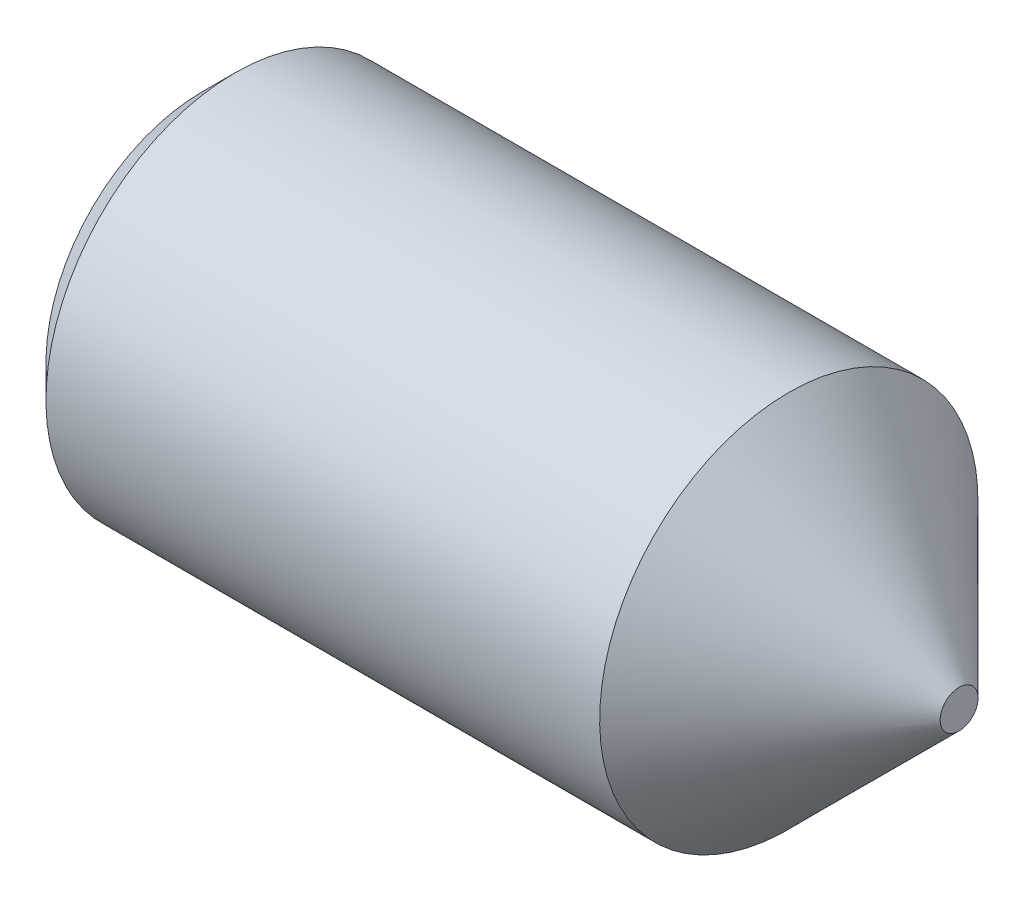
ISO-10303-21;
HEADER;
FILE_DESCRIPTION(('STEP AP214'),'2;1');
FILE_NAME('part.step','',(''),(''),'','','');
FILE_SCHEMA(('AUTOMOTIVE_DESIGN { 1 0 10303 214 1 1 1 1 }'));
ENDSEC;
DATA;
#1=APPLICATION_CONTEXT('core data for automotive mechanical design processes');
#2=APPLICATION_PROTOCOL_DEFINITION('international standard','automotive_design',2000,#1);
#3=PRODUCT_CONTEXT('',#1,'mechanical');
#4=PRODUCT('Part','Part','',(#3));
#5=PRODUCT_RELATED_PRODUCT_CATEGORY('part','',(#4));
#6=PRODUCT_DEFINITION_FORMATION('','',#4);
#7=PRODUCT_DEFINITION_CONTEXT('part definition',#1,'design');
#8=PRODUCT_DEFINITION('design','',#6,#7);
#9=PRODUCT_DEFINITION_SHAPE('','',#8);
#10=(LENGTH_UNIT() NAMED_UNIT(*) SI_UNIT(.MILLI.,.METRE.));
#11=(NAMED_UNIT(*) PLANE_ANGLE_UNIT() SI_UNIT($,.RADIAN.));
#12=(NAMED_UNIT(*) SI_UNIT($,.STERADIAN.) SOLID_ANGLE_UNIT());
#13=UNCERTAINTY_MEASURE_WITH_UNIT(LENGTH_MEASURE(1.E-05),#10,'distance_accuracy_value','');
#14=(GEOMETRIC_REPRESENTATION_CONTEXT(3) GLOBAL_UNCERTAINTY_ASSIGNED_CONTEXT((#13)) GLOBAL_UNIT_ASSIGNED_CONTEXT((#10,
#11,#12)) REPRESENTATION_CONTEXT('',''));
#15=CARTESIAN_POINT('',(0.,0.,0.));
#16=DIRECTION('',(0.,0.,1.));
#17=DIRECTION('',(1.,0.,0.));
#18=AXIS2_PLACEMENT_3D('',#15,#16,#17);
#19=CARTESIAN_POINT('',(10.,0.,0.));
#20=DIRECTION('',(1.,0.,0.));
#21=DIRECTION('',(0.,1.,0.));
#22=AXIS2_PLACEMENT_3D('',#19,#20,#21);
#23=PLANE('',#22);
#24=CARTESIAN_POINT('',(10.,0.,0.));
#25=DIRECTION('',(1.,0.,0.));
#26=DIRECTION('',(0.,1.,0.));
#27=AXIS2_PLACEMENT_3D('',#24,#25,#26);
#28=CIRCLE('',#27,0.25);
#29=CARTESIAN_POINT('',(10.,0.25,0.));
#30=VERTEX_POINT('',#29);
#31=EDGE_CURVE('E10',#30,#30,#28,.T.);
#32=ORIENTED_EDGE('',*,*,#31,.T.);
#33=EDGE_LOOP('',(#32));
#34=FACE_BOUND('',#33,.T.);
#35=ADVANCED_FACE('F16',(#34),#23,.T.);
#36=CARTESIAN_POINT('',(8.875,0.,0.));
#37=DIRECTION('',(-1.,0.,0.));
#38=DIRECTION('',(0.,-1.,0.));
#39=AXIS2_PLACEMENT_3D('',#36,#37,#38);
#40=CONICAL_SURFACE('',#39,1.375,0.78539816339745);
#41=ORIENTED_EDGE('',*,*,#31,.F.);
#42=EDGE_LOOP('',(#41));
#43=FACE_BOUND('',#42,.T.);
#44=CARTESIAN_POINT('',(7.75,0.,0.));
#45=DIRECTION('',(1.,0.,0.));
#46=DIRECTION('',(0.,1.,0.));
#47=AXIS2_PLACEMENT_3D('',#44,#45,#46);
#48=CIRCLE('',#47,2.5);
#49=CARTESIAN_POINT('',(7.75,2.5,0.));
#50=VERTEX_POINT('',#49);
#51=EDGE_CURVE('E27',#50,#50,#48,.T.);
#52=ORIENTED_EDGE('',*,*,#51,.T.);
#53=EDGE_LOOP('',(#52));
#54=FACE_BOUND('',#53,.T.);
#55=ADVANCED_FACE('F291',(#43,#54),#40,.T.);
#56=CARTESIAN_POINT('',(0.433012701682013,0.,0.));
#57=DIRECTION('',(1.,0.,0.));
#58=DIRECTION('',(0.,1.,0.));
#59=AXIS2_PLACEMENT_3D('',#56,#57,#58);
#60=CYLINDRICAL_SURFACE('',#59,2.5);
#61=ORIENTED_EDGE('',*,*,#51,.F.);
#62=EDGE_LOOP('',(#61));
#63=FACE_BOUND('',#62,.T.);
#64=CARTESIAN_POINT('',(0.433012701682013,0.,0.));
#65=DIRECTION('',(1.,0.,0.));
#66=DIRECTION('',(0.,1.,0.));
#67=AXIS2_PLACEMENT_3D('',#64,#65,#66);
#68=CIRCLE('',#67,2.5);
#69=CARTESIAN_POINT('',(0.433012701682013,2.5,0.));
#70=VERTEX_POINT('',#69);
#71=EDGE_CURVE('E154',#70,#70,#68,.T.);
#72=ORIENTED_EDGE('',*,*,#71,.T.);
#73=EDGE_LOOP('',(#72));
#74=FACE_BOUND('',#73,.T.);
#75=ADVANCED_FACE('F18',(#63,#74),#60,.T.);
#76=CARTESIAN_POINT('',(3.,0.,0.));
#77=DIRECTION('',(-1.,0.,0.));
#78=DIRECTION('',(0.,0.,1.));
#79=AXIS2_PLACEMENT_3D('',#76,#77,#78);
#80=PLANE('',#79);
#81=DIRECTION('',(0.,-0.5,-0.86602540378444));
#82=VECTOR('',#81,1.);
#83=CARTESIAN_POINT('',(3.,1.44337567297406,0.));
#84=LINE('',#83,#82);
#85=CARTESIAN_POINT('',(3.,1.44337567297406,0.));
#86=VERTEX_POINT('',#85);
#87=CARTESIAN_POINT('',(3.,0.721687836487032,-1.25));
#88=VERTEX_POINT('',#87);
#89=EDGE_CURVE('E20',#86,#88,#84,.T.);
#90=ORIENTED_EDGE('',*,*,#89,.T.);
#91=DIRECTION('',(0.,-1.,0.));
#92=VECTOR('',#91,1.);
#93=CARTESIAN_POINT('',(3.,0.721687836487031,-1.25));
#94=LINE('',#93,#92);
#95=CARTESIAN_POINT('',(3.,-0.721687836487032,-1.25));
#96=VERTEX_POINT('',#95);
#97=EDGE_CURVE('E106',#88,#96,#94,.T.);
#98=ORIENTED_EDGE('',*,*,#97,.T.);
#99=DIRECTION('',(0.,-0.5,0.866025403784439));
#100=VECTOR('',#99,1.);
#101=CARTESIAN_POINT('',(3.,-0.721687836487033,-1.25));
#102=LINE('',#101,#100);
#103=CARTESIAN_POINT('',(3.,-1.44337567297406,0.));
#104=VERTEX_POINT('',#103);
#105=EDGE_CURVE('E102',#96,#104,#102,.T.);
#106=ORIENTED_EDGE('',*,*,#105,.T.);
#107=DIRECTION('',(0.,0.5,0.866025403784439));
#108=VECTOR('',#107,1.);
#109=CARTESIAN_POINT('',(3.,-1.44337567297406,0.));
#110=LINE('',#109,#108);
#111=CARTESIAN_POINT('',(3.,-0.72168783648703,1.25));
#112=VERTEX_POINT('',#111);
#113=EDGE_CURVE('E134',#104,#112,#110,.T.);
#114=ORIENTED_EDGE('',*,*,#113,.T.);
#115=DIRECTION('',(0.,1.,0.));
#116=VECTOR('',#115,1.);
#117=CARTESIAN_POINT('',(3.,-0.721687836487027,1.25));
#118=LINE('',#117,#116);
#119=CARTESIAN_POINT('',(3.,0.721687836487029,1.25));
#120=VERTEX_POINT('',#119);
#121=EDGE_CURVE('E141',#112,#120,#118,.T.);
#122=ORIENTED_EDGE('',*,*,#121,.T.);
#123=DIRECTION('',(0.,0.500000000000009,-0.866025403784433));
#124=VECTOR('',#123,1.);
#125=CARTESIAN_POINT('',(3.,0.721687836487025,1.25));
#126=LINE('',#125,#124);
#127=EDGE_CURVE('E151',#120,#86,#126,.T.);
#128=ORIENTED_EDGE('',*,*,#127,.T.);
#129=EDGE_LOOP('',(#90,#98,#106,#114,#122,#128));
#130=FACE_BOUND('',#129,.T.);
#131=ADVANCED_FACE('F182',(#130),#80,.T.);
#132=CARTESIAN_POINT('',(0.216506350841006,0.,0.));
#133=DIRECTION('',(1.,0.,0.));
#134=DIRECTION('',(0.,1.,0.));
#135=AXIS2_PLACEMENT_3D('',#132,#133,#134);
#136=CONICAL_SURFACE('',#135,2.283493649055,0.785398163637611);
#137=ORIENTED_EDGE('',*,*,#71,.F.);
#138=EDGE_LOOP('',(#137));
#139=FACE_BOUND('',#138,.T.);
#140=CARTESIAN_POINT('',(0.,0.,0.));
#141=DIRECTION('',(1.,0.,0.));
#142=DIRECTION('',(0.,1.,0.));
#143=AXIS2_PLACEMENT_3D('',#140,#141,#142);
#144=CIRCLE('',#143,2.06698729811);
#145=CARTESIAN_POINT('',(0.,2.06698729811,0.));
#146=VERTEX_POINT('',#145);
#147=EDGE_CURVE('E228',#146,#146,#144,.T.);
#148=ORIENTED_EDGE('',*,*,#147,.T.);
#149=EDGE_LOOP('',(#148));
#150=FACE_BOUND('',#149,.T.);
#151=ADVANCED_FACE('F301',(#139,#150),#136,.T.);
#152=CARTESIAN_POINT('',(3.,1.44337567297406,0.));
#153=DIRECTION('',(0.,0.86602540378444,-0.5));
#154=DIRECTION('',(-1.,0.,0.));
#155=AXIS2_PLACEMENT_3D('',#152,#153,#154);
#156=PLANE('',#155);
#157=DIRECTION('',(0.,0.5,0.86602540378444));
#158=VECTOR('',#157,1.);
#159=CARTESIAN_POINT('',(0.,1.44337567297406,0.));
#160=LINE('',#159,#158);
#161=CARTESIAN_POINT('',(0.,0.721687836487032,-1.25));
#162=VERTEX_POINT('',#161);
#163=CARTESIAN_POINT('',(0.,1.44337567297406,0.));
#164=VERTEX_POINT('',#163);
#165=EDGE_CURVE('E133',#162,#164,#160,.T.);
#166=ORIENTED_EDGE('',*,*,#165,.F.);
#167=DIRECTION('',(-1.,0.,0.));
#168=VECTOR('',#167,1.);
#169=CARTESIAN_POINT('',(3.,0.721687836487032,-1.25));
#170=LINE('',#169,#168);
#171=EDGE_CURVE('E112',#88,#162,#170,.T.);
#172=ORIENTED_EDGE('',*,*,#171,.F.);
#173=ORIENTED_EDGE('',*,*,#89,.F.);
#174=DIRECTION('',(-1.,0.,0.));
#175=VECTOR('',#174,1.);
#176=CARTESIAN_POINT('',(3.,1.44337567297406,0.));
#177=LINE('',#176,#175);
#178=EDGE_CURVE('E117',#86,#164,#177,.T.);
#179=ORIENTED_EDGE('',*,*,#178,.T.);
#180=EDGE_LOOP('',(#166,#172,#173,#179));
#181=FACE_BOUND('',#180,.T.);
#182=ADVANCED_FACE('F226',(#181),#156,.F.);
#183=CARTESIAN_POINT('',(3.,0.721687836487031,-1.25));
#184=DIRECTION('',(0.,0.,-1.));
#185=DIRECTION('',(0.,-1.,0.));
#186=AXIS2_PLACEMENT_3D('',#183,#184,#185);
#187=PLANE('',#186);
#188=DIRECTION('',(0.,1.,0.));
#189=VECTOR('',#188,1.);
#190=CARTESIAN_POINT('',(0.,0.721687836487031,-1.25));
#191=LINE('',#190,#189);
#192=CARTESIAN_POINT('',(0.,-0.721687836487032,-1.25));
#193=VERTEX_POINT('',#192);
#194=EDGE_CURVE('E109',#193,#162,#191,.T.);
#195=ORIENTED_EDGE('',*,*,#194,.F.);
#196=DIRECTION('',(-1.,0.,0.));
#197=VECTOR('',#196,1.);
#198=CARTESIAN_POINT('',(3.,-0.721687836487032,-1.25));
#199=LINE('',#198,#197);
#200=EDGE_CURVE('E95',#96,#193,#199,.T.);
#201=ORIENTED_EDGE('',*,*,#200,.F.);
#202=ORIENTED_EDGE('',*,*,#97,.F.);
#203=ORIENTED_EDGE('',*,*,#171,.T.);
#204=EDGE_LOOP('',(#195,#201,#202,#203));
#205=FACE_BOUND('',#204,.T.);
#206=ADVANCED_FACE('F110',(#205),#187,.F.);
#207=CARTESIAN_POINT('',(3.,-0.721687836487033,-1.25));
#208=DIRECTION('',(0.,-0.866025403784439,-0.5));
#209=DIRECTION('',(0.,0.5,-0.866025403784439));
#210=AXIS2_PLACEMENT_3D('',#207,#208,#209);
#211=PLANE('',#210);
#212=DIRECTION('',(0.,0.5,-0.866025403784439));
#213=VECTOR('',#212,1.);
#214=CARTESIAN_POINT('',(0.,-0.721687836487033,-1.25));
#215=LINE('',#214,#213);
#216=CARTESIAN_POINT('',(0.,-1.44337567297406,0.));
#217=VERTEX_POINT('',#216);
#218=EDGE_CURVE('E100',#217,#193,#215,.T.);
#219=ORIENTED_EDGE('',*,*,#218,.F.);
#220=DIRECTION('',(-1.,0.,0.));
#221=VECTOR('',#220,1.);
#222=CARTESIAN_POINT('',(3.,-1.44337567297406,0.));
#223=LINE('',#222,#221);
#224=EDGE_CURVE('E137',#104,#217,#223,.T.);
#225=ORIENTED_EDGE('',*,*,#224,.F.);
#226=ORIENTED_EDGE('',*,*,#105,.F.);
#227=ORIENTED_EDGE('',*,*,#200,.T.);
#228=EDGE_LOOP('',(#219,#225,#226,#227));
#229=FACE_BOUND('',#228,.T.);
#230=ADVANCED_FACE('F97',(#229),#211,.F.);
#231=CARTESIAN_POINT('',(3.,-1.44337567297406,0.));
#232=DIRECTION('',(0.,-0.866025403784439,0.5));
#233=DIRECTION('',(-1.,0.,0.));
#234=AXIS2_PLACEMENT_3D('',#231,#232,#233);
#235=PLANE('',#234);
#236=DIRECTION('',(0.,-0.5,-0.866025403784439));
#237=VECTOR('',#236,1.);
#238=CARTESIAN_POINT('',(0.,-1.44337567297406,0.));
#239=LINE('',#238,#237);
#240=CARTESIAN_POINT('',(0.,-0.72168783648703,1.25));
#241=VERTEX_POINT('',#240);
#242=EDGE_CURVE('E122',#241,#217,#239,.T.);
#243=ORIENTED_EDGE('',*,*,#242,.F.);
#244=DIRECTION('',(-1.,0.,0.));
#245=VECTOR('',#244,1.);
#246=CARTESIAN_POINT('',(3.,-0.72168783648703,1.25));
#247=LINE('',#246,#245);
#248=EDGE_CURVE('E138',#112,#241,#247,.T.);
#249=ORIENTED_EDGE('',*,*,#248,.F.);
#250=ORIENTED_EDGE('',*,*,#113,.F.);
#251=ORIENTED_EDGE('',*,*,#224,.T.);
#252=EDGE_LOOP('',(#243,#249,#250,#251));
#253=FACE_BOUND('',#252,.T.);
#254=ADVANCED_FACE('F310',(#253),#235,.F.);
#255=CARTESIAN_POINT('',(3.,-0.721687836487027,1.25));
#256=DIRECTION('',(0.,0.,1.));
#257=DIRECTION('',(0.,-1.,0.));
#258=AXIS2_PLACEMENT_3D('',#255,#256,#257);
#259=PLANE('',#258);
#260=DIRECTION('',(0.,-1.,0.));
#261=VECTOR('',#260,1.);
#262=CARTESIAN_POINT('',(0.,-0.721687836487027,1.25));
#263=LINE('',#262,#261);
#264=CARTESIAN_POINT('',(0.,0.721687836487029,1.25));
#265=VERTEX_POINT('',#264);
#266=EDGE_CURVE('E129',#265,#241,#263,.T.);
#267=ORIENTED_EDGE('',*,*,#266,.F.);
#268=DIRECTION('',(-1.,0.,0.));
#269=VECTOR('',#268,1.);
#270=CARTESIAN_POINT('',(3.,0.721687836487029,1.25));
#271=LINE('',#270,#269);
#272=EDGE_CURVE('E148',#120,#265,#271,.T.);
#273=ORIENTED_EDGE('',*,*,#272,.F.);
#274=ORIENTED_EDGE('',*,*,#121,.F.);
#275=ORIENTED_EDGE('',*,*,#248,.T.);
#276=EDGE_LOOP('',(#267,#273,#274,#275));
#277=FACE_BOUND('',#276,.T.);
#278=ADVANCED_FACE('F246',(#277),#259,.F.);
#279=CARTESIAN_POINT('',(3.,0.721687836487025,1.25));
#280=DIRECTION('',(0.,0.866025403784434,0.500000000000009));
#281=DIRECTION('',(1.,0.,0.));
#282=AXIS2_PLACEMENT_3D('',#279,#280,#281);
#283=PLANE('',#282);
#284=DIRECTION('',(0.,-0.500000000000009,0.866025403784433));
#285=VECTOR('',#284,1.);
#286=CARTESIAN_POINT('',(0.,0.721687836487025,1.25));
#287=LINE('',#286,#285);
#288=EDGE_CURVE('E142',#164,#265,#287,.T.);
#289=ORIENTED_EDGE('',*,*,#288,.F.);
#290=ORIENTED_EDGE('',*,*,#178,.F.);
#291=ORIENTED_EDGE('',*,*,#127,.F.);
#292=ORIENTED_EDGE('',*,*,#272,.T.);
#293=EDGE_LOOP('',(#289,#290,#291,#292));
#294=FACE_BOUND('',#293,.T.);
#295=ADVANCED_FACE('F248',(#294),#283,.F.);
#296=CARTESIAN_POINT('',(0.,0.,0.));
#297=DIRECTION('',(-1.,0.,0.));
#298=DIRECTION('',(0.,0.,1.));
#299=AXIS2_PLACEMENT_3D('',#296,#297,#298);
#300=PLANE('',#299);
#301=ORIENTED_EDGE('',*,*,#165,.T.);
#302=ORIENTED_EDGE('',*,*,#288,.T.);
#303=ORIENTED_EDGE('',*,*,#266,.T.);
#304=ORIENTED_EDGE('',*,*,#242,.T.);
#305=ORIENTED_EDGE('',*,*,#218,.T.);
#306=ORIENTED_EDGE('',*,*,#194,.T.);
#307=EDGE_LOOP('',(#301,#302,#303,#304,#305,#306));
#308=FACE_BOUND('',#307,.T.);
#309=ORIENTED_EDGE('',*,*,#147,.F.);
#310=EDGE_LOOP('',(#309));
#311=FACE_BOUND('',#310,.T.);
#312=ADVANCED_FACE('F118',(#308,#311),#300,.T.);
#313=CLOSED_SHELL('',(#35,#55,#75,#131,#151,#182,#206,#230,#254,#278,#295,#312));
#314=MANIFOLD_SOLID_BREP('B1',#313);
#315=ADVANCED_BREP_SHAPE_REPRESENTATION('',(#18,#314),#14);
#316=SHAPE_DEFINITION_REPRESENTATION(#9,#315);
ENDSEC;
END-ISO-10303-21;
